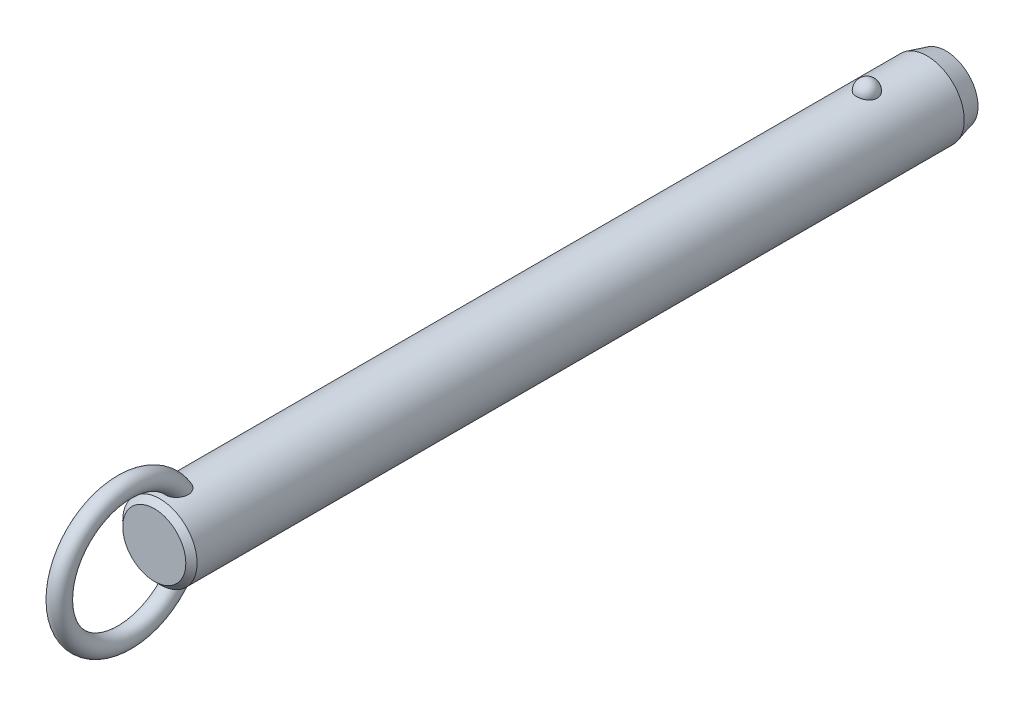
ISO-10303-21;
HEADER;
FILE_DESCRIPTION(('STEP AP214'),'2;1');
FILE_NAME('part.step','',(''),(''),'','','');
FILE_SCHEMA(('AUTOMOTIVE_DESIGN { 1 0 10303 214 1 1 1 1 }'));
ENDSEC;
DATA;
#1=APPLICATION_CONTEXT('core data for automotive mechanical design processes');
#2=APPLICATION_PROTOCOL_DEFINITION('international standard','automotive_design',2000,#1);
#3=PRODUCT_CONTEXT('',#1,'mechanical');
#4=PRODUCT('Part','Part','',(#3));
#5=PRODUCT_RELATED_PRODUCT_CATEGORY('part','',(#4));
#6=PRODUCT_DEFINITION_FORMATION('','',#4);
#7=PRODUCT_DEFINITION_CONTEXT('part definition',#1,'design');
#8=PRODUCT_DEFINITION('design','',#6,#7);
#9=PRODUCT_DEFINITION_SHAPE('','',#8);
#10=(LENGTH_UNIT() NAMED_UNIT(*) SI_UNIT(.MILLI.,.METRE.));
#11=(NAMED_UNIT(*) PLANE_ANGLE_UNIT() SI_UNIT($,.RADIAN.));
#12=(NAMED_UNIT(*) SI_UNIT($,.STERADIAN.) SOLID_ANGLE_UNIT());
#13=UNCERTAINTY_MEASURE_WITH_UNIT(LENGTH_MEASURE(1.E-05),#10,'distance_accuracy_value','');
#14=(GEOMETRIC_REPRESENTATION_CONTEXT(3) GLOBAL_UNCERTAINTY_ASSIGNED_CONTEXT((#13)) GLOBAL_UNIT_ASSIGNED_CONTEXT((#10,
#11,#12)) REPRESENTATION_CONTEXT('',''));
#15=CARTESIAN_POINT('',(0.,0.,0.));
#16=DIRECTION('',(0.,0.,1.));
#17=DIRECTION('',(1.,0.,0.));
#18=AXIS2_PLACEMENT_3D('',#15,#16,#17);
#19=CARTESIAN_POINT('',(0.,0.,139.7));
#20=DIRECTION('',(0.,0.,-1.));
#21=DIRECTION('',(-1.,0.,0.));
#22=AXIS2_PLACEMENT_3D('',#19,#20,#21);
#23=CYLINDRICAL_SURFACE('',#22,7.9);
#24=CARTESIAN_POINT('',(2.1785689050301,7.59367088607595,-2.19999999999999));
#25=CARTESIAN_POINT('',(2.17856679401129,7.59367269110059,-2.07701843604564));
#26=CARTESIAN_POINT('',(2.16853481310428,7.59657145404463,-1.95401006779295));
#27=CARTESIAN_POINT('',(2.12864689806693,7.607843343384,-1.71147811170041));
#28=CARTESIAN_POINT('',(2.09878338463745,7.61621856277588,-1.59195587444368));
#29=CARTESIAN_POINT('',(2.0199931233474,7.63749180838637,-1.3598563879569));
#30=CARTESIAN_POINT('',(1.97107475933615,7.6503878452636,-1.24727610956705));
#31=CARTESIAN_POINT('',(1.85539377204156,7.67926115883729,-1.03213234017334));
#32=CARTESIAN_POINT('',(1.78863158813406,7.69523835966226,-0.929568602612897));
#33=CARTESIAN_POINT('',(1.63856494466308,7.7285848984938,-0.736786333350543));
#34=CARTESIAN_POINT('',(1.55518140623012,7.7459606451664,-0.646630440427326));
#35=CARTESIAN_POINT('',(1.37422937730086,7.78009978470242,-0.481747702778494));
#36=CARTESIAN_POINT('',(1.27666086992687,7.79686317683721,-0.407020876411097));
#37=CARTESIAN_POINT('',(1.07024728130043,7.82786153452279,-0.275278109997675));
#38=CARTESIAN_POINT('',(0.961434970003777,7.84210353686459,-0.218212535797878));
#39=CARTESIAN_POINT('',(0.735351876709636,7.86652194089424,-0.123146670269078));
#40=CARTESIAN_POINT('',(0.618082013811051,7.87669878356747,-0.085144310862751));
#41=CARTESIAN_POINT('',(0.380637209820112,7.89170521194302,-0.0298158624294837));
#42=CARTESIAN_POINT('',(0.260550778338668,7.89662650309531,-0.0121347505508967));
#43=CARTESIAN_POINT('',(0.0190117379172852,7.90090003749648,0.00324379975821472));
#44=CARTESIAN_POINT('',(-0.102440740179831,7.90025280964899,0.00094313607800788));
#45=CARTESIAN_POINT('',(-0.341452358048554,7.89351056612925,-0.0233955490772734));
#46=CARTESIAN_POINT('',(-0.459042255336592,7.88749257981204,-0.0451545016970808));
#47=CARTESIAN_POINT('',(-0.688796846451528,7.87075812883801,-0.107408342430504));
#48=CARTESIAN_POINT('',(-0.800961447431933,7.86004158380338,-0.147903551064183));
#49=CARTESIAN_POINT('',(-1.01743634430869,7.83497131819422,-0.246799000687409));
#50=CARTESIAN_POINT('',(-1.12169791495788,7.82059709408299,-0.305300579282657));
#51=CARTESIAN_POINT('',(-1.31891765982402,7.78976470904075,-0.438549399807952));
#52=CARTESIAN_POINT('',(-1.41187469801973,7.77330633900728,-0.513298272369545));
#53=CARTESIAN_POINT('',(-1.58577142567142,7.73972434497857,-0.678622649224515));
#54=CARTESIAN_POINT('',(-1.66645140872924,7.72259402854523,-0.769470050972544));
#55=CARTESIAN_POINT('',(-1.81161503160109,7.68983776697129,-0.963538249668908));
#56=CARTESIAN_POINT('',(-1.87609753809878,7.6742119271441,-1.06675991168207));
#57=CARTESIAN_POINT('',(-1.98790138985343,7.6460202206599,-1.28401170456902));
#58=CARTESIAN_POINT('',(-2.03501994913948,7.63349104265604,-1.39815107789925));
#59=CARTESIAN_POINT('',(-2.10986724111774,7.6131449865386,-1.63301784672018));
#60=CARTESIAN_POINT('',(-2.1375965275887,7.60532797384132,-1.75374505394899));
#61=CARTESIAN_POINT('',(-2.17289256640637,7.5953195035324,-1.99782562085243));
#62=CARTESIAN_POINT('',(-2.18054294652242,7.59310471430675,-2.12116592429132));
#63=CARTESIAN_POINT('',(-2.17572919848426,7.59448538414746,-2.36741799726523));
#64=CARTESIAN_POINT('',(-2.1632656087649,7.59808068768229,-2.49032977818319));
#65=CARTESIAN_POINT('',(-2.11865035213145,7.61064035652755,-2.73161015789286));
#66=CARTESIAN_POINT('',(-2.08659579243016,7.61957823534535,-2.84999812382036));
#67=CARTESIAN_POINT('',(-2.00367799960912,7.64179982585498,-3.07955956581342));
#68=CARTESIAN_POINT('',(-1.9528140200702,7.65508371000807,-3.19073275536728));
#69=CARTESIAN_POINT('',(-1.83321113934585,7.68460381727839,-3.40337899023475));
#70=CARTESIAN_POINT('',(-1.76437735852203,7.70085556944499,-3.50479651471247));
#71=CARTESIAN_POINT('',(-1.61069526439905,7.73445734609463,-3.69446912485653));
#72=CARTESIAN_POINT('',(-1.52584634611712,7.75180741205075,-3.78272371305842));
#73=CARTESIAN_POINT('',(-1.34198059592,7.78574608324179,-3.94393987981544));
#74=CARTESIAN_POINT('',(-1.24291308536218,7.80233167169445,-4.01684434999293));
#75=CARTESIAN_POINT('',(-1.03352039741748,7.83281625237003,-4.14489386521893));
#76=CARTESIAN_POINT('',(-0.92319600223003,7.84671543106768,-4.20004014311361));
#77=CARTESIAN_POINT('',(-0.695822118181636,7.87011575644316,-4.29042017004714));
#78=CARTESIAN_POINT('',(-0.578872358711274,7.87966903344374,-4.32589112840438));
#79=CARTESIAN_POINT('',(-0.340410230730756,7.8935652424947,-4.37692226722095));
#80=CARTESIAN_POINT('',(-0.218898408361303,7.89790879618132,-4.39248482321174));
#81=CARTESIAN_POINT('',(0.0228107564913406,7.90087453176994,-4.40314405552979));
#82=CARTESIAN_POINT('',(0.142990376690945,7.89960185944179,-4.39861683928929));
#83=CARTESIAN_POINT('',(0.380829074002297,7.89171262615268,-4.37008293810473));
#84=CARTESIAN_POINT('',(0.498488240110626,7.8850962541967,-4.34607694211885));
#85=CARTESIAN_POINT('',(0.727535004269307,7.86726442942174,-4.27939317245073));
#86=CARTESIAN_POINT('',(0.838944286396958,7.85606616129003,-4.236785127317));
#87=CARTESIAN_POINT('',(1.05295421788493,7.83025654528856,-4.13408348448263));
#88=CARTESIAN_POINT('',(1.15555431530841,7.81564498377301,-4.07398879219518));
#89=CARTESIAN_POINT('',(1.35076763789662,7.7843022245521,-3.93687432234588));
#90=CARTESIAN_POINT('',(1.4432046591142,7.76754209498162,-3.85961036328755));
#91=CARTESIAN_POINT('',(1.6139111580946,7.73387857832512,-3.69076949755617));
#92=CARTESIAN_POINT('',(1.6921781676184,7.71697516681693,-3.59919010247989));
#93=CARTESIAN_POINT('',(1.83380875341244,7.6845643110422,-3.40247278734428));
#94=CARTESIAN_POINT('',(1.89689280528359,7.66908588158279,-3.29712873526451));
#95=CARTESIAN_POINT('',(2.0047823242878,7.64159441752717,-3.07707931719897));
#96=CARTESIAN_POINT('',(2.0495945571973,7.62958010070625,-2.96237743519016));
#97=CARTESIAN_POINT('',(2.11580183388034,7.61146617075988,-2.74040519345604));
#98=CARTESIAN_POINT('',(2.13929812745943,7.60484503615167,-2.63379846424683));
#99=CARTESIAN_POINT('',(2.17068242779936,7.59594664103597,-2.41813481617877));
#100=CARTESIAN_POINT('',(2.17857077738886,7.59366928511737,-2.30907795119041));
#101=CARTESIAN_POINT('',(2.1785689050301,7.59367088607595,-2.19999999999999));
#102=B_SPLINE_CURVE_WITH_KNOTS('',3,(#24,#25,#26,#27,#28,#29,#30,#31,#32,#33,#34,#35,#36,#37,
#38,#39,#40,#41,#42,#43,#44,#45,#46,#47,#48,#49,#50,#51,#52,#53,#54,#55,#56,#57,#58,#59,#60,#61,
#62,#63,#64,#65,#66,#67,#68,#69,#70,#71,#72,#73,#74,#75,#76,#77,#78,#79,#80,#81,#82,#83,#84,#85,
#86,#87,#88,#89,#90,#91,#92,#93,#94,#95,#96,#97,#98,#99,#100,#101),.UNSPECIFIED.,.T.,.F.,(4,2,2,
2,2,2,2,2,2,2,2,2,2,2,2,2,2,2,2,2,2,2,2,2,2,2,2,2,2,2,2,2,2,2,2,2,2,2,4),(0.,0.368552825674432,
0.737246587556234,1.10577831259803,1.4743009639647,1.8446206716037,2.21494081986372,
2.5842105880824,2.95344028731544,3.31611630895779,3.67875788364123,4.03628044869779,
4.39380913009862,4.75338791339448,5.11300280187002,5.47939989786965,5.8458226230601,
6.21639834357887,6.58696347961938,6.95598276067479,7.32499216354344,7.69218715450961,
8.0593967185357,8.42858578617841,8.79778880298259,9.16834203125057,9.5388695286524,
9.90482699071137,10.2707407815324,10.6298333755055,10.9889132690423,11.3466585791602,
11.7044262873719,12.0676511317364,12.4309391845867,12.8004764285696,13.1698767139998,
13.4967701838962,13.8236564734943),.UNSPECIFIED.);
#103=CARTESIAN_POINT('',(2.1785689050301,7.59367088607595,-2.19999999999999));
#104=VERTEX_POINT('',#103);
#105=EDGE_CURVE('E41',#104,#104,#102,.T.);
#106=ORIENTED_EDGE('',*,*,#105,.T.);
#107=EDGE_LOOP('',(#106));
#108=FACE_BOUND('',#107,.T.);
#109=CARTESIAN_POINT('',(0.,0.,148.02));
#110=DIRECTION('',(0.,0.,1.));
#111=DIRECTION('',(1.,0.,0.));
#112=AXIS2_PLACEMENT_3D('',#109,#110,#111);
#113=CIRCLE('',#112,7.9);
#114=CARTESIAN_POINT('',(7.9,0.,148.02));
#115=VERTEX_POINT('',#114);
#116=EDGE_CURVE('E10',#115,#115,#113,.F.);
#117=ORIENTED_EDGE('',*,*,#116,.T.);
#118=EDGE_LOOP('',(#117));
#119=FACE_BOUND('',#118,.T.);
#120=CARTESIAN_POINT('',(-0.630969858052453,-7.87476203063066,141.912432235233));
#121=CARTESIAN_POINT('',(-0.734180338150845,-7.86648998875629,141.947285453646));
#122=CARTESIAN_POINT('',(-0.834476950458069,-7.85639291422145,141.990816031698));
#123=CARTESIAN_POINT('',(-1.0262035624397,-7.83366343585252,142.094094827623));
#124=CARTESIAN_POINT('',(-1.1176141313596,-7.82102565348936,142.153877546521));
#125=CARTESIAN_POINT('',(-1.28877277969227,-7.79464922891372,142.287839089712));
#126=CARTESIAN_POINT('',(-1.36854014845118,-7.78091246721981,142.361993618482));
#127=CARTESIAN_POINT('',(-1.5146152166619,-7.75380398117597,142.522494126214));
#128=CARTESIAN_POINT('',(-1.58092966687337,-7.74043207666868,142.608833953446));
#129=CARTESIAN_POINT('',(-1.70019064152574,-7.7151252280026,142.792978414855));
#130=CARTESIAN_POINT('',(-1.75284037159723,-7.70322473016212,142.890979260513));
#131=CARTESIAN_POINT('',(-1.84263464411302,-7.68224112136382,143.094102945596));
#132=CARTESIAN_POINT('',(-1.87977299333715,-7.6731591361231,143.199228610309));
#133=CARTESIAN_POINT('',(-1.94152728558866,-7.65777930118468,143.423284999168));
#134=CARTESIAN_POINT('',(-1.96475471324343,-7.65179654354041,143.542616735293));
#135=CARTESIAN_POINT('',(-1.99449499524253,-7.64409642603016,143.78342986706));
#136=CARTESIAN_POINT('',(-2.0010005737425,-7.64238092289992,143.904912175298));
#137=CARTESIAN_POINT('',(-1.99856014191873,-7.64302120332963,144.168340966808));
#138=CARTESIAN_POINT('',(-1.98680021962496,-7.64611845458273,144.31025654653));
#139=CARTESIAN_POINT('',(-1.94457772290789,-7.65696186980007,144.591118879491));
#140=CARTESIAN_POINT('',(-1.91409393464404,-7.66471330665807,144.730062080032));
#141=CARTESIAN_POINT('',(-1.82768670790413,-7.68582947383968,145.031939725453));
#142=CARTESIAN_POINT('',(-1.76772963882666,-7.70003779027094,145.193686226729));
#143=CARTESIAN_POINT('',(-1.65998501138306,-7.72371550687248,145.427695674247));
#144=CARTESIAN_POINT('',(-1.62107967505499,-7.73200670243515,145.504297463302));
#145=CARTESIAN_POINT('',(-1.53727726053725,-7.7491037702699,145.654079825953));
#146=CARTESIAN_POINT('',(-1.49238215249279,-7.75790947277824,145.727261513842));
#147=CARTESIAN_POINT('',(-1.37397050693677,-7.77993338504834,145.90288382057));
#148=CARTESIAN_POINT('',(-1.29690364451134,-7.79328473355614,146.002955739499));
#149=CARTESIAN_POINT('',(-1.12885487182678,-7.81939266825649,146.190714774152));
#150=CARTESIAN_POINT('',(-1.03789926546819,-7.83215032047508,146.278424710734));
#151=CARTESIAN_POINT('',(-0.869532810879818,-7.85231710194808,146.413414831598));
#152=CARTESIAN_POINT('',(-0.795716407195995,-7.86021093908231,146.465076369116));
#153=CARTESIAN_POINT('',(-0.640813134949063,-7.87434920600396,146.556381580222));
#154=CARTESIAN_POINT('',(-0.559737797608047,-7.88059619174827,146.59604389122));
#155=CARTESIAN_POINT('',(-0.406456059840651,-7.88984116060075,146.654300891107));
#156=CARTESIAN_POINT('',(-0.335227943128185,-7.89321892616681,146.675384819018));
#157=CARTESIAN_POINT('',(-0.190193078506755,-7.89804235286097,146.70541418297));
#158=CARTESIAN_POINT('',(-0.116388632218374,-7.89948969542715,146.714370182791));
#159=CARTESIAN_POINT('',(0.0318414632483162,-7.90028409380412,146.719291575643));
#160=CARTESIAN_POINT('',(0.106268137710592,-7.89962640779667,146.715227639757));
#161=CARTESIAN_POINT('',(0.253290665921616,-7.8962818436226,146.694461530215));
#162=CARTESIAN_POINT('',(0.325885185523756,-7.8935935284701,146.677750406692));
#163=CARTESIAN_POINT('',(0.481441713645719,-7.88577340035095,146.628738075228));
#164=CARTESIAN_POINT('',(0.563611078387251,-7.88026321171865,146.594005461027));
#165=CARTESIAN_POINT('',(0.721129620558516,-7.86741729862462,146.511796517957));
#166=CARTESIAN_POINT('',(0.79646633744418,-7.86007832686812,146.464297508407));
#167=CARTESIAN_POINT('',(0.971456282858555,-7.84073285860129,146.336513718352));
#168=CARTESIAN_POINT('',(1.06719686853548,-7.82809461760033,146.251004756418));
#169=CARTESIAN_POINT('',(1.24418921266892,-7.80192439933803,146.066232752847));
#170=CARTESIAN_POINT('',(1.32540832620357,-7.78839049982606,145.966939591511));
#171=CARTESIAN_POINT('',(1.45199971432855,-7.76559693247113,145.789576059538));
#172=CARTESIAN_POINT('',(1.50085649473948,-7.75626094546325,145.713954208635));
#173=CARTESIAN_POINT('',(1.59197749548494,-7.73807279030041,145.558742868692));
#174=CARTESIAN_POINT('',(1.63423919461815,-7.72922080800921,145.479151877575));
#175=CARTESIAN_POINT('',(1.71222612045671,-7.71231959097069,145.316664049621));
#176=CARTESIAN_POINT('',(1.74794516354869,-7.70427111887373,145.233764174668));
#177=CARTESIAN_POINT('',(1.81270113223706,-7.68929240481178,145.065296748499));
#178=CARTESIAN_POINT('',(1.84173789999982,-7.68236218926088,144.979729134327));
#179=CARTESIAN_POINT('',(1.89322698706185,-7.6698375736,144.80528702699));
#180=CARTESIAN_POINT('',(1.91558744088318,-7.66426199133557,144.716383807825));
#181=CARTESIAN_POINT('',(1.95281367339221,-7.65485915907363,144.536969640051));
#182=CARTESIAN_POINT('',(1.96767946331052,-7.65103190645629,144.446458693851));
#183=CARTESIAN_POINT('',(2.0002145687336,-7.64262981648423,144.173732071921));
#184=CARTESIAN_POINT('',(2.00600691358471,-7.6410871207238,143.989709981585));
#185=CARTESIAN_POINT('',(1.98445334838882,-7.64669564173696,143.676501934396));
#186=CARTESIAN_POINT('',(1.96607186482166,-7.65149688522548,143.546618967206));
#187=CARTESIAN_POINT('',(1.90884967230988,-7.66597624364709,143.291632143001));
#188=CARTESIAN_POINT('',(1.87002101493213,-7.67565148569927,143.166525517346));
#189=CARTESIAN_POINT('',(1.77063986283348,-7.69918471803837,142.92454013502));
#190=CARTESIAN_POINT('',(1.70993724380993,-7.71307150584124,142.807725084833));
#191=CARTESIAN_POINT('',(1.56733070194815,-7.74330306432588,142.588144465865));
#192=CARTESIAN_POINT('',(1.48543692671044,-7.75964665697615,142.485372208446));
#193=CARTESIAN_POINT('',(1.31346177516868,-7.79047523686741,142.309380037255));
#194=CARTESIAN_POINT('',(1.22547278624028,-7.80495298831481,142.234106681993));
#195=CARTESIAN_POINT('',(1.03724352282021,-7.83218597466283,142.100486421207));
#196=CARTESIAN_POINT('',(0.937008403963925,-7.84494192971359,142.042132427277));
#197=CARTESIAN_POINT('',(0.733599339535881,-7.86649045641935,141.947027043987));
#198=CARTESIAN_POINT('',(0.630941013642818,-7.87547134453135,141.909210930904));
#199=CARTESIAN_POINT('',(0.420465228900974,-7.88950708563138,141.851116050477));
#200=CARTESIAN_POINT('',(0.31264590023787,-7.89456050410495,141.83084369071));
#201=CARTESIAN_POINT('',(0.096086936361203,-7.9001518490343,141.808455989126));
#202=CARTESIAN_POINT('',(-0.0126341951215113,-7.90073226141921,141.806169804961));
#203=CARTESIAN_POINT('',(-0.228766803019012,-7.89742350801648,141.819367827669));
#204=CARTESIAN_POINT('',(-0.336180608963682,-7.89354403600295,141.834813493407));
#205=CARTESIAN_POINT('',(-0.473410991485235,-7.88586871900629,141.866217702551));
#206=CARTESIAN_POINT('',(-0.50525779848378,-7.88388984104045,141.874354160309));
#207=CARTESIAN_POINT('',(-0.56848128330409,-7.87958326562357,141.892208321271));
#208=CARTESIAN_POINT('',(-0.59985795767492,-7.87725556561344,141.901926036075));
#209=CARTESIAN_POINT('',(-0.630969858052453,-7.87476203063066,141.912432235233));
#210=B_SPLINE_CURVE_WITH_KNOTS('',3,(#120,#121,#122,#123,#124,#125,#126,#127,#128,#129,#130,
#131,#132,#133,#134,#135,#136,#137,#138,#139,#140,#141,#142,#143,#144,#145,#146,#147,#148,#149,
#150,#151,#152,#153,#154,#155,#156,#157,#158,#159,#160,#161,#162,#163,#164,#165,#166,#167,#168,
#169,#170,#171,#172,#173,#174,#175,#176,#177,#178,#179,#180,#181,#182,#183,#184,#185,#186,#187,
#188,#189,#190,#191,#192,#193,#194,#195,#196,#197,#198,#199,#200,#201,#202,#203,#204,#205,#206,
#207,#208,#209),.UNSPECIFIED.,.T.,.F.,(4,2,2,2,2,2,2,2,2,2,2,2,2,2,2,2,2,2,2,2,2,2,2,2,2,2,2,2,
2,2,2,2,2,2,2,2,2,2,2,2,2,2,2,2,4),(0.,0.327622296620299,0.655945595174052,0.983718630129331,
1.31132677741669,1.64554655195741,1.97989964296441,2.34365728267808,2.70757317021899,
3.13333684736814,3.5595838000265,4.07655306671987,4.33527897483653,4.59391999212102,
4.97382437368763,5.353017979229,5.62348245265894,5.89352465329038,6.11565959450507,
6.33760092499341,6.56004255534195,6.78264174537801,7.04930844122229,7.31645206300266,
7.70130871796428,8.08701995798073,8.35824509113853,8.6295736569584,8.90115735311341,
9.1727474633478,9.44791855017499,9.72308922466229,10.2715298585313,10.6638393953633,
11.0559179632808,11.4507403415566,11.8453740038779,12.1936425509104,12.5417649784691,
12.8695063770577,13.1973674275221,13.5221104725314,13.8461490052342,13.9449071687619,
14.0436660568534),.UNSPECIFIED.);
#211=CARTESIAN_POINT('',(-0.630969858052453,-7.87476203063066,141.912432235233));
#212=VERTEX_POINT('',#211);
#213=EDGE_CURVE('E60',#212,#212,#210,.T.);
#214=ORIENTED_EDGE('',*,*,#213,.T.);
#215=EDGE_LOOP('',(#214));
#216=FACE_BOUND('',#215,.T.);
#217=CARTESIAN_POINT('',(-0.630969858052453,7.87476203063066,141.912432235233));
#218=CARTESIAN_POINT('',(-0.528918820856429,7.88293636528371,141.877979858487));
#219=CARTESIAN_POINT('',(-0.423745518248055,7.88934810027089,141.851915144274));
#220=CARTESIAN_POINT('',(-0.210236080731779,7.8979273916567,141.817282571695));
#221=CARTESIAN_POINT('',(-0.10189380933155,7.90008607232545,141.808751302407));
#222=CARTESIAN_POINT('',(0.114660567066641,7.89990877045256,141.809457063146));
#223=CARTESIAN_POINT('',(0.222872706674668,7.89757640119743,141.81867980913));
#224=CARTESIAN_POINT('',(0.436107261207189,7.88867538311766,141.854652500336));
#225=CARTESIAN_POINT('',(0.541131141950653,7.8821087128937,141.88139425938));
#226=CARTESIAN_POINT('',(0.745085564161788,7.86545130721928,141.951756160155));
#227=CARTESIAN_POINT('',(0.844015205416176,7.85536005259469,141.995378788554));
#228=CARTESIAN_POINT('',(1.03299167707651,7.83275153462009,142.098379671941));
#229=CARTESIAN_POINT('',(1.12303841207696,7.8202342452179,142.157758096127));
#230=CARTESIAN_POINT('',(1.29214734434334,7.79408219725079,142.290864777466));
#231=CARTESIAN_POINT('',(1.37116907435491,7.78044359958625,142.364643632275));
#232=CARTESIAN_POINT('',(1.51597677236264,7.75353170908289,142.524235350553));
#233=CARTESIAN_POINT('',(1.58176261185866,7.74025841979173,142.610048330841));
#234=CARTESIAN_POINT('',(1.70057386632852,7.71504069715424,142.793644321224));
#235=CARTESIAN_POINT('',(1.75320073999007,7.7031425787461,142.891690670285));
#236=CARTESIAN_POINT('',(1.8429376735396,7.68216822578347,143.094893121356));
#237=CARTESIAN_POINT('',(1.88004278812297,7.67309289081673,143.200051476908));
#238=CARTESIAN_POINT('',(1.9417232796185,7.6577294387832,143.424167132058));
#239=CARTESIAN_POINT('',(1.96491037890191,7.65175648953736,143.543524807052));
#240=CARTESIAN_POINT('',(1.9945689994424,7.64407702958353,143.784384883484));
#241=CARTESIAN_POINT('',(2.00103304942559,7.64237242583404,143.90588821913));
#242=CARTESIAN_POINT('',(1.99850166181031,7.64303650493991,144.169368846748));
#243=CARTESIAN_POINT('',(1.98669038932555,7.64614714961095,144.311314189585));
#244=CARTESIAN_POINT('',(1.94436120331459,7.65701701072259,144.592228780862));
#245=CARTESIAN_POINT('',(1.91382203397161,7.66478150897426,144.731194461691));
#246=CARTESIAN_POINT('',(1.82728754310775,7.68592483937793,145.033111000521));
#247=CARTESIAN_POINT('',(1.76725778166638,7.70014685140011,145.194872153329));
#248=CARTESIAN_POINT('',(1.65939700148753,7.72384204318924,145.428891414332));
#249=CARTESIAN_POINT('',(1.62045187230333,7.73213852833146,145.505494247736));
#250=CARTESIAN_POINT('',(1.5365668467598,7.74924489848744,145.655273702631));
#251=CARTESIAN_POINT('',(1.49162892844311,7.75805461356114,145.728451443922));
#252=CARTESIAN_POINT('',(1.37317698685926,7.78007342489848,145.903952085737));
#253=CARTESIAN_POINT('',(1.29612360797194,7.79341423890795,146.003911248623));
#254=CARTESIAN_POINT('',(1.12812043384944,7.81949839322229,146.19145083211));
#255=CARTESIAN_POINT('',(1.03719688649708,7.83224280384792,146.279054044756));
#256=CARTESIAN_POINT('',(0.868871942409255,7.85239026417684,146.41389715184));
#257=CARTESIAN_POINT('',(0.795056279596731,7.86027769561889,146.465511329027));
#258=CARTESIAN_POINT('',(0.640160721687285,7.87440222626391,146.556720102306));
#259=CARTESIAN_POINT('',(0.559092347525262,7.88064188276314,146.596333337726));
#260=CARTESIAN_POINT('',(0.405820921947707,7.8898738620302,146.654505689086));
#261=CARTESIAN_POINT('',(0.334594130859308,7.89324577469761,146.675552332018));
#262=CARTESIAN_POINT('',(0.189568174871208,7.89805733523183,146.705507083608));
#263=CARTESIAN_POINT('',(0.115771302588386,7.89949866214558,146.714425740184));
#264=CARTESIAN_POINT('',(-0.0324359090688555,7.90028156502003,146.71927589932));
#265=CARTESIAN_POINT('',(-0.106847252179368,7.89961843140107,146.715178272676));
#266=CARTESIAN_POINT('',(-0.253834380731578,7.8962642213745,146.694351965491));
#267=CARTESIAN_POINT('',(-0.326408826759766,7.89357170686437,146.677614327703));
#268=CARTESIAN_POINT('',(-0.481962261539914,7.88574179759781,146.628539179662));
#269=CARTESIAN_POINT('',(-0.564145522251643,7.88022507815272,146.593763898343));
#270=CARTESIAN_POINT('',(-0.721685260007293,7.86736646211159,146.511468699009));
#271=CARTESIAN_POINT('',(-0.797029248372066,7.8600213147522,146.463926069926));
#272=CARTESIAN_POINT('',(-0.9720442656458,7.84066026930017,146.336026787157));
#273=CARTESIAN_POINT('',(-1.06779803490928,7.82801274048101,146.250443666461));
#274=CARTESIAN_POINT('',(-1.2448053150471,7.80182621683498,146.065522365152));
#275=CARTESIAN_POINT('',(-1.32602618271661,7.78828530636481,145.966154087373));
#276=CARTESIAN_POINT('',(-1.4525983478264,7.76548487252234,145.788680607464));
#277=CARTESIAN_POINT('',(-1.50143856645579,7.75614818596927,145.713025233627));
#278=CARTESIAN_POINT('',(-1.59252410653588,7.73796020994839,145.557748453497));
#279=CARTESIAN_POINT('',(-1.63476690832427,7.72910910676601,145.478125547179));
#280=CARTESIAN_POINT('',(-1.71271318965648,7.71221133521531,145.315575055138));
#281=CARTESIAN_POINT('',(-1.74841047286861,7.70416543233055,145.232644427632));
#282=CARTESIAN_POINT('',(-1.81311929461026,7.6891937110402,145.064116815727));
#283=CARTESIAN_POINT('',(-1.84213067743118,7.68226791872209,144.978519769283));
#284=CARTESIAN_POINT('',(-1.89356259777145,7.66975461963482,144.804025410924));
#285=CARTESIAN_POINT('',(-1.91589165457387,7.66418586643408,144.715099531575));
#286=CARTESIAN_POINT('',(-1.9530507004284,7.65479859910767,144.535642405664));
#287=CARTESIAN_POINT('',(-1.96788069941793,7.65098008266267,144.445111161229));
#288=CARTESIAN_POINT('',(-2.00030078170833,7.64260704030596,144.172327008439));
#289=CARTESIAN_POINT('',(-2.00600576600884,7.64108760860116,143.988271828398));
#290=CARTESIAN_POINT('',(-1.9842848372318,7.64673945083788,143.675080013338));
#291=CARTESIAN_POINT('',(-1.96583698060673,7.65155751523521,143.545240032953));
#292=CARTESIAN_POINT('',(-1.90848948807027,7.66606613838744,143.290361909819));
#293=CARTESIAN_POINT('',(-1.86960376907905,7.67575338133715,143.165320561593));
#294=CARTESIAN_POINT('',(-1.77013421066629,7.6993013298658,142.923500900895));
#295=CARTESIAN_POINT('',(-1.70940488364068,7.71318991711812,142.806784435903));
#296=CARTESIAN_POINT('',(-1.56672953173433,7.74342495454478,142.587340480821));
#297=CARTESIAN_POINT('',(-1.48478316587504,7.75977144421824,142.48461321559));
#298=CARTESIAN_POINT('',(-1.31266325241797,7.79061163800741,142.308643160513));
#299=CARTESIAN_POINT('',(-1.22456383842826,7.80509908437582,142.233358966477));
#300=CARTESIAN_POINT('',(-1.03622400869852,7.83231881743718,142.099865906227));
#301=CARTESIAN_POINT('',(-0.936015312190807,7.84505551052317,142.041613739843));
#302=CARTESIAN_POINT('',(-0.798824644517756,7.85957802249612,141.977540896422));
#303=CARTESIAN_POINT('',(-0.765787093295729,7.86286821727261,141.963224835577));
#304=CARTESIAN_POINT('',(-0.698939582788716,7.86909211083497,141.936436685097));
#305=CARTESIAN_POINT('',(-0.66512963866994,7.8720258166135,141.923964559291));
#306=CARTESIAN_POINT('',(-0.630969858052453,7.87476203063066,141.912432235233));
#307=B_SPLINE_CURVE_WITH_KNOTS('',3,(#217,#218,#219,#220,#221,#222,#223,#224,#225,#226,#227,
#228,#229,#230,#231,#232,#233,#234,#235,#236,#237,#238,#239,#240,#241,#242,#243,#244,#245,#246,
#247,#248,#249,#250,#251,#252,#253,#254,#255,#256,#257,#258,#259,#260,#261,#262,#263,#264,#265,
#266,#267,#268,#269,#270,#271,#272,#273,#274,#275,#276,#277,#278,#279,#280,#281,#282,#283,#284,
#285,#286,#287,#288,#289,#290,#291,#292,#293,#294,#295,#296,#297,#298,#299,#300,#301,#302,#303,
#304,#305,#306),.UNSPECIFIED.,.T.,.F.,(4,2,2,2,2,2,2,2,2,2,2,2,2,2,2,2,2,2,2,2,2,2,2,2,2,2,2,2,
2,2,2,2,2,2,2,2,2,2,2,2,2,2,2,2,4),(0.,0.323920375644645,0.648516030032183,0.972850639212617,
1.29703380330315,1.62126473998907,1.94549915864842,2.27089401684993,2.5962920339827,
2.93059633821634,3.26500707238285,3.6288164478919,3.99278833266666,4.4186542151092,
4.84500434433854,5.36209210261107,5.62087589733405,5.87957448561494,6.25918598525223,
6.63808782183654,6.90846748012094,7.17842501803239,7.40052350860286,7.6224287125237,
7.84483086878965,8.06739077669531,8.33414615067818,8.60137921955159,8.98641454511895,
9.37230415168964,9.64358673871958,9.91497268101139,10.1866142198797,10.4582620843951,
10.7334745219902,11.008686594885,11.5572126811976,11.9494246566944,12.3413699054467,
12.7359755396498,13.1305875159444,13.4791770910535,13.82687259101,13.9353013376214,
14.0437279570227),.UNSPECIFIED.);
#308=CARTESIAN_POINT('',(-0.630969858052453,7.87476203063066,141.912432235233));
#309=VERTEX_POINT('',#308);
#310=EDGE_CURVE('E68',#309,#309,#307,.T.);
#311=ORIENTED_EDGE('',*,*,#310,.T.);
#312=EDGE_LOOP('',(#311));
#313=FACE_BOUND('',#312,.T.);
#314=CARTESIAN_POINT('',(0.,0.,-15.));
#315=DIRECTION('',(0.,0.,-1.));
#316=DIRECTION('',(-1.,0.,0.));
#317=AXIS2_PLACEMENT_3D('',#314,#315,#316);
#318=CIRCLE('',#317,7.9);
#319=CARTESIAN_POINT('',(-7.9,0.,-15.));
#320=VERTEX_POINT('',#319);
#321=EDGE_CURVE('E57',#320,#320,#318,.F.);
#322=ORIENTED_EDGE('',*,*,#321,.T.);
#323=EDGE_LOOP('',(#322));
#324=FACE_BOUND('',#323,.T.);
#325=ADVANCED_FACE('F37',(#108,#119,#216,#313,#324),#23,.T.);
#326=CARTESIAN_POINT('',(0.,0.,-19.));
#327=DIRECTION('',(0.,0.,-1.));
#328=DIRECTION('',(-1.,0.,0.));
#329=AXIS2_PLACEMENT_3D('',#326,#327,#328);
#330=PLANE('',#329);
#331=CARTESIAN_POINT('',(0.,0.,-19.));
#332=DIRECTION('',(0.,0.,-1.));
#333=DIRECTION('',(-1.,0.,0.));
#334=AXIS2_PLACEMENT_3D('',#331,#332,#333);
#335=CIRCLE('',#334,6.82820323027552);
#336=CARTESIAN_POINT('',(-6.82820323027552,0.,-19.));
#337=VERTEX_POINT('',#336);
#338=EDGE_CURVE('E67',#337,#337,#335,.T.);
#339=ORIENTED_EDGE('',*,*,#338,.T.);
#340=EDGE_LOOP('',(#339));
#341=FACE_BOUND('',#340,.T.);
#342=ADVANCED_FACE('F86',(#341),#330,.T.);
#343=CARTESIAN_POINT('',(0.,0.,-19.));
#344=DIRECTION('',(0.,0.,1.));
#345=DIRECTION('',(1.,0.,0.));
#346=AXIS2_PLACEMENT_3D('',#343,#344,#345);
#347=CONICAL_SURFACE('',#346,6.82820323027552,0.261799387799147);
#348=ORIENTED_EDGE('',*,*,#321,.F.);
#349=EDGE_LOOP('',(#348));
#350=FACE_BOUND('',#349,.T.);
#351=ORIENTED_EDGE('',*,*,#338,.F.);
#352=EDGE_LOOP('',(#351));
#353=FACE_BOUND('',#352,.T.);
#354=ADVANCED_FACE('F84',(#350,#353),#347,.T.);
#355=CARTESIAN_POINT('',(0.,0.,149.22));
#356=DIRECTION('',(0.,0.,1.));
#357=DIRECTION('',(1.,0.,0.));
#358=AXIS2_PLACEMENT_3D('',#355,#356,#357);
#359=PLANE('',#358);
#360=CARTESIAN_POINT('',(0.,0.,149.22));
#361=DIRECTION('',(0.,0.,1.));
#362=DIRECTION('',(1.,0.,0.));
#363=AXIS2_PLACEMENT_3D('',#360,#361,#362);
#364=CIRCLE('',#363,6.69999999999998);
#365=CARTESIAN_POINT('',(6.69999999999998,0.,149.22));
#366=VERTEX_POINT('',#365);
#367=EDGE_CURVE('E50',#366,#366,#364,.T.);
#368=ORIENTED_EDGE('',*,*,#367,.T.);
#369=EDGE_LOOP('',(#368));
#370=FACE_BOUND('',#369,.T.);
#371=ADVANCED_FACE('F78',(#370),#359,.T.);
#372=CARTESIAN_POINT('',(0.,0.,155.55));
#373=DIRECTION('',(1.,0.,0.));
#374=DIRECTION('',(0.,0.,-1.));
#375=AXIS2_PLACEMENT_3D('',#372,#373,#374);
#376=TOROIDAL_SURFACE('',#375,13.85,2.);
#377=ORIENTED_EDGE('',*,*,#310,.F.);
#378=EDGE_LOOP('',(#377));
#379=FACE_BOUND('',#378,.T.);
#380=ORIENTED_EDGE('',*,*,#213,.F.);
#381=EDGE_LOOP('',(#380));
#382=FACE_BOUND('',#381,.T.);
#383=ADVANCED_FACE('F74',(#379,#382),#376,.T.);
#384=CARTESIAN_POINT('',(0.,0.,149.22));
#385=DIRECTION('',(0.,0.,-1.));
#386=DIRECTION('',(-1.,0.,0.));
#387=AXIS2_PLACEMENT_3D('',#384,#385,#386);
#388=CONICAL_SURFACE('',#387,6.69999999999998,0.785398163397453);
#389=ORIENTED_EDGE('',*,*,#116,.F.);
#390=EDGE_LOOP('',(#389));
#391=FACE_BOUND('',#390,.T.);
#392=ORIENTED_EDGE('',*,*,#367,.F.);
#393=EDGE_LOOP('',(#392));
#394=FACE_BOUND('',#393,.T.);
#395=ADVANCED_FACE('F39',(#391,#394),#388,.T.);
#396=CARTESIAN_POINT('',(0.,7.9,-2.19999999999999));
#397=DIRECTION('',(0.,1.,0.));
#398=DIRECTION('',(0.,0.,-1.));
#399=AXIS2_PLACEMENT_3D('',#396,#397,#398);
#400=SPHERICAL_SURFACE('',#399,2.2);
#401=ORIENTED_EDGE('',*,*,#105,.F.);
#402=EDGE_LOOP('',(#401));
#403=FACE_BOUND('',#402,.T.);
#404=ADVANCED_FACE('F80',(#403),#400,.T.);
#405=CLOSED_SHELL('',(#325,#342,#354,#371,#383,#395,#404));
#406=MANIFOLD_SOLID_BREP('B2',#405);
#407=ADVANCED_BREP_SHAPE_REPRESENTATION('',(#18,#406),#14);
#408=SHAPE_DEFINITION_REPRESENTATION(#9,#407);
ENDSEC;
END-ISO-10303-21;
